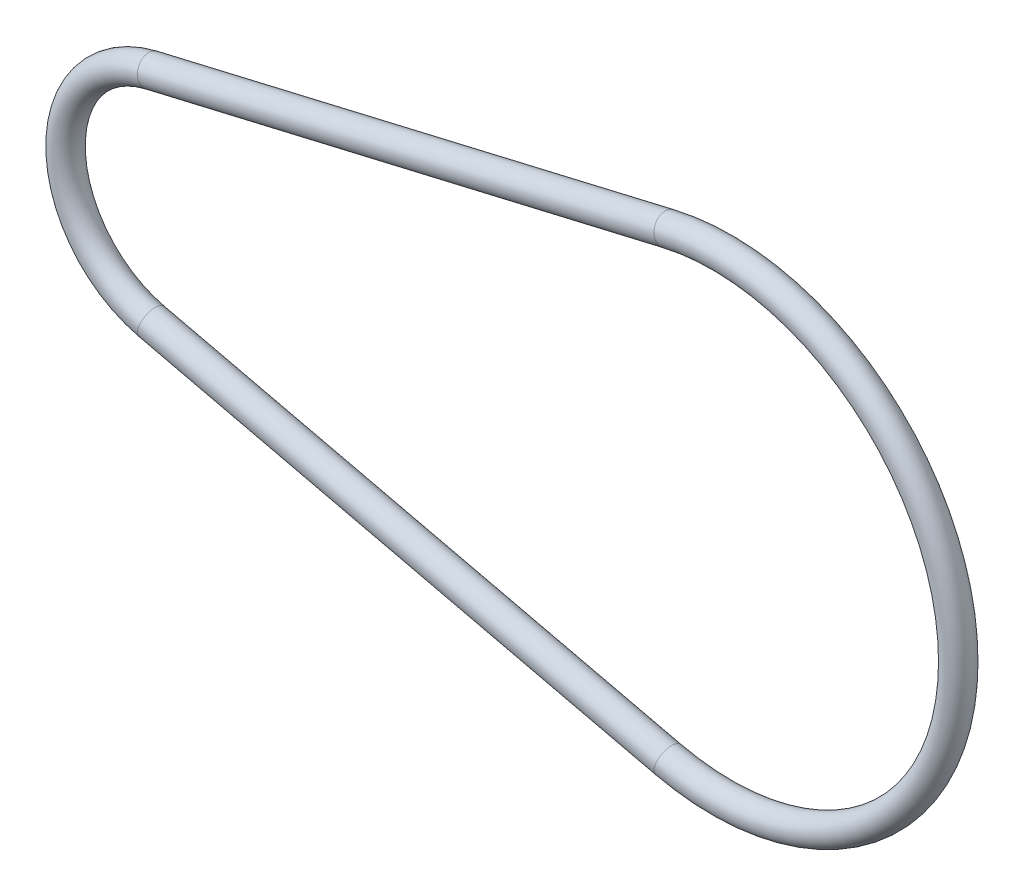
from build123d import *

# Parameters (mm, degrees)
ESQUISSE2_R = 1


with BuildPart() as part:
    # Balayage1: sweep along a path in Esquisse1
    with BuildLine(Plane.XY) as balayage1_path:
        Line((-1.825641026, 7.788904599), (35.143333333, 16.454060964))
        ThreePointArc((35.143333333, 16.454060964), (55.9, 0), (35.143333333, -16.454060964))
        Line((35.143333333, -16.454060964), (-1.825641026, -7.788904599))
        ThreePointArc((-1.825641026, -7.788904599), (-8, 0), (-1.825641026, 7.788904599))
    # Esquisse2 → Balayage1 (sweep)
    with BuildSketch(Plane(origin=(0, 0, 0), x_dir=(1, 0, 0), z_dir=(0, 1, 0))):
        with Locations((55.9, 0)):
            Circle(ESQUISSE2_R)
    sweep(path=balayage1_path.line)


solid = part.part
